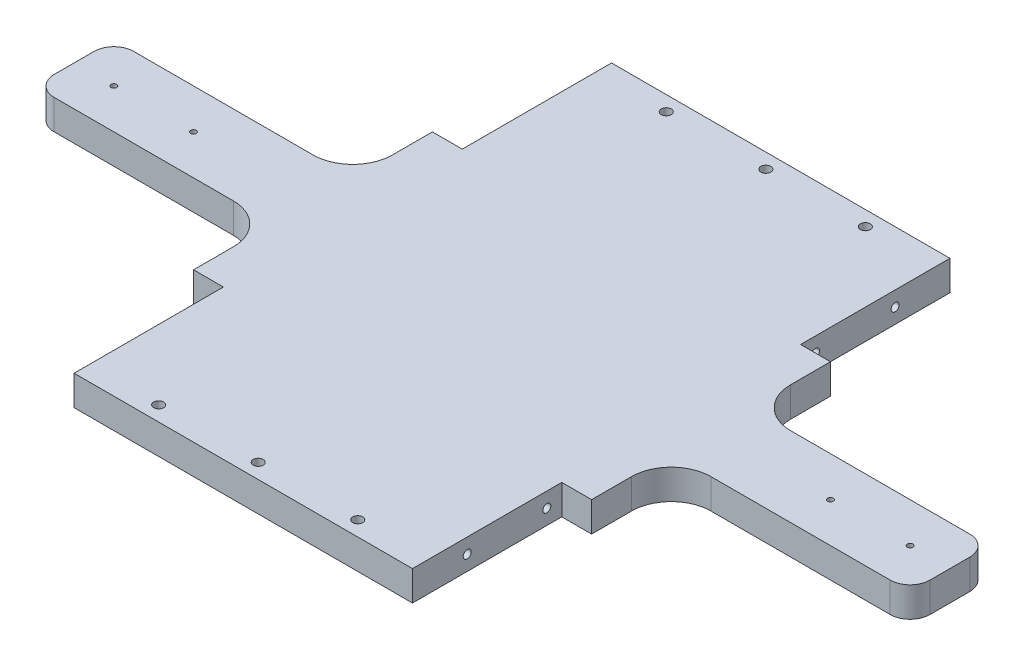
from build123d import *

# Parameters (mm, degrees)
SKETCH1_W                   = 152.4
SKETCH1_H                   = 50.8
SKETCH1_W_2                 = 254
SKETCH1_H_2                 = 342.9
BOSS_EXTRUDE1_DEPTH         = 19.05
SKETCH2_R                   = 1.778
CUT_EXTRUDE1_DEPTH          = 329.363160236
FILLET1_R                   = 12.7
FILLET2_R                   = 12.7
FILLET3_R                   = 12.7
FILLET4_R                   = 12.7
FILLET5_R                   = 25.4
FILLET6_R                   = 25.4
FILLET7_R                   = 25.4
FILLET8_R                   = 25.4
F_1_4_0_25_DIAMETER_HOLE1_D = 6.35
F_1_4_0_25_DIAMETER_HOLE2_D = 6.35
MIRROR2_COPY_1_D            = 6.35
SKETCH8_W                   = 95.25
SKETCH8_H                   = 19.05
CUT_EXTRUDE2_DEPTH          = 19.05
MIRROR5_COPY_1_SKETCH_W     = 95.25
MIRROR5_COPY_1_SKETCH_H     = 19.05
MIRROR5_COPY_1_DEPTH        = 19.05
MIRROR5_COPY_2_SKETCH_W     = 95.25
MIRROR5_COPY_2_SKETCH_H     = 19.05
MIRROR5_COPY_2_DEPTH        = 19.05


with BuildPart() as part:
    # Sketch1 → Boss-Extrude1 (new body)
    with BuildSketch(Plane(origin=(0, 0, 0), x_dir=(1, 0, 0), z_dir=(0, 1, 0))):
        with Locations((-203.2, 0)):
            Rectangle(SKETCH1_W, SKETCH1_H)
        Rectangle(SKETCH1_W_2, SKETCH1_H_2)
        with Locations((203.2, 0)):
            Rectangle(SKETCH1_W, SKETCH1_H)
    extrude(amount=BOSS_EXTRUDE1_DEPTH)

    # Sketch2 → Cut-Extrude1 (cut, through all)
    with BuildSketch(Plane(origin=(0, 19.05, 0), x_dir=(1, 0, 0), z_dir=(0, 1, 0))):
        with Locations(Location((-203.200007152, -0.033015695, 0), (0, 0, 270))):
            Circle(SKETCH2_R)
        with Locations(Location((-254.000002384, -0.0110051, 0), (0, 0, 270))):
            Circle(SKETCH2_R)
        with Locations(Location((203.2, 0, 0), (0, 0, 270))):
            Circle(SKETCH2_R)
        with Locations(Location((254, 0, 0), (0, 0, 270))):
            Circle(SKETCH2_R)
    extrude(amount=-CUT_EXTRUDE1_DEPTH, mode=Mode.SUBTRACT)

    # Fillet1
    fillet1_edges = [part.edges().sort_by_distance(p)[0] for p in [
        (-279.4, 9.525, 25.4),
    ]]
    fillet(fillet1_edges, radius=FILLET1_R)

    # Fillet2
    fillet2_edges = [part.edges().sort_by_distance(p)[0] for p in [
        (-279.4, 9.525, -25.4),
    ]]
    fillet(fillet2_edges, radius=FILLET2_R)

    # Fillet3
    fillet3_edges = [part.edges().sort_by_distance(p)[0] for p in [
        (279.4, 9.525, -25.4),
    ]]
    fillet(fillet3_edges, radius=FILLET3_R)

    # Fillet4
    fillet4_edges = [part.edges().sort_by_distance(p)[0] for p in [
        (279.4, 9.525, 25.4),
    ]]
    fillet(fillet4_edges, radius=FILLET4_R)

    # Fillet5
    fillet5_edges = [part.edges().sort_by_distance(p)[0] for p in [
        (127, 9.525, -25.4),
    ]]
    fillet(fillet5_edges, radius=FILLET5_R)

    # Fillet6
    fillet6_edges = [part.edges().sort_by_distance(p)[0] for p in [
        (127, 9.525, 25.4),
    ]]
    fillet(fillet6_edges, radius=FILLET6_R)

    # Fillet7
    fillet7_edges = [part.edges().sort_by_distance(p)[0] for p in [
        (-127, 9.525, 25.4),
    ]]
    fillet(fillet7_edges, radius=FILLET7_R)

    # Fillet8
    fillet8_edges = [part.edges().sort_by_distance(p)[0] for p in [
        (-127, 9.525, -25.4),
    ]]
    fillet(fillet8_edges, radius=FILLET8_R)

    # 1_4 _0.25_ Diameter Hole1 (through all)
    with Locations(Plane(origin=(0, 19.05, 0), x_dir=(1, 0, 0), z_dir=(0, 1, 0))):
        with Locations((63.5, 161.925)):
            f_1_4_0_25_diameter_hole1 = Hole(F_1_4_0_25_DIAMETER_HOLE1_D / 2)

    # Mirror1: 1_4 _0.25_ Diameter Hole1 across plane
    add(f_1_4_0_25_diameter_hole1.mirror(Plane(origin=(0, 0, 0), x_dir=(0, 0, 1), z_dir=(1, 0, 0))), mode=Mode.SUBTRACT)

    # 1_4 _0.25_ Diameter Hole2 (through all)
    with Locations(Plane(origin=(0, 19.05, 0), x_dir=(1, 0, 0), z_dir=(0, 1, 0))):
        with Locations((0, 161.925)):
            f_1_4_0_25_diameter_hole2 = Hole(F_1_4_0_25_DIAMETER_HOLE2_D / 2)

    # Mirror2: 1_4 _0.25_ Diameter Hole1, 1_4 _0.25_ Diameter Hole2 across plane
    add(f_1_4_0_25_diameter_hole1.mirror(Plane.XY), mode=Mode.SUBTRACT)
    add(f_1_4_0_25_diameter_hole2.mirror(Plane.XY), mode=Mode.SUBTRACT)

    # Mirror2 copy 1 (through all)
    with Locations(Plane(origin=(0, 19.05, 0), x_dir=(-1, 0, 0), z_dir=(0, 1, 0))):
        with Locations((63.5, 161.925)):
            Hole(MIRROR2_COPY_1_D / 2)

    # Sketch8 → Cut-Extrude2 (cut)
    with BuildSketch(Plane(origin=(127, 0, 0), x_dir=(0, 0, -1), z_dir=(1, 0, 0))):
        with Locations((123.825, 9.525)):
            Rectangle(SKETCH8_W, SKETCH8_H)
    cut_extrude2 = extrude(amount=-CUT_EXTRUDE2_DEPTH, mode=Mode.SUBTRACT)

    # Mirror3: Cut-Extrude2 across plane
    add(cut_extrude2.mirror(Plane.XY), mode=Mode.SUBTRACT)

    # Mirror4: Cut-Extrude2 across plane
    add(cut_extrude2.mirror(Plane(origin=(0, 0, 0), x_dir=(0, 0, 1), z_dir=(1, 0, 0))), mode=Mode.SUBTRACT)

    # Mirror5 copy 1 sketch → Mirror5 copy 1 (cut)
    with BuildSketch(Plane.ZY.offset(127)):
        with Locations((123.825, 9.525)):
            Rectangle(MIRROR5_COPY_1_SKETCH_W, MIRROR5_COPY_1_SKETCH_H)
    extrude(amount=-MIRROR5_COPY_1_DEPTH, mode=Mode.SUBTRACT)

    # Mirror5 copy 2 sketch → Mirror5 copy 2 (cut)
    with BuildSketch(Plane(origin=(127, 0, 0), x_dir=(0, 0, 1), z_dir=(1, 0, 0))):
        with Locations((123.825, -9.525)):
            Rectangle(MIRROR5_COPY_2_SKETCH_W, MIRROR5_COPY_2_SKETCH_H)
    extrude(amount=-MIRROR5_COPY_2_DEPTH, mode=Mode.SUBTRACT)

    # Sketch12 → 7 _0.201_ Diameter Hole1 (revolve, cut)
    with BuildSketch(Plane(origin=(-107.95, 9.525, -85.725), x_dir=(0, 0, 1), z_dir=(0, 1, 0))):
        Polygon((0, 0), (0, 52.333816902), (2.5527, 50.8), (2.5527, 0), align=None)
    f_7_0_201_diameter_hole1 = revolve(axis=Axis((-114.3, 9.525, -85.725), (1, 0, 0)), mode=Mode.SUBTRACT)

    # Sketch14 → 7 _0.201_ Diameter Hole2 (revolve, cut)
    with BuildSketch(Plane(origin=(-107.95, 9.525, -136.525), x_dir=(0, 0, 1), z_dir=(0, 1, 0))):
        Polygon((0, 0), (0, 52.333816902), (2.5527, 50.8), (2.5527, 0), align=None)
    f_7_0_201_diameter_hole2 = revolve(axis=Axis((-114.3, 9.525, -136.525), (1, 0, 0)), mode=Mode.SUBTRACT)

    # Mirror6: 7 _0.201_ Diameter Hole1, 7 _0.201_ Diameter Hole2 across plane
    add(f_7_0_201_diameter_hole1.mirror(Plane(origin=(0, 0, 0), x_dir=(0, 0, 1), z_dir=(1, 0, 0))), mode=Mode.SUBTRACT)
    add(f_7_0_201_diameter_hole2.mirror(Plane(origin=(0, 0, 0), x_dir=(0, 0, 1), z_dir=(1, 0, 0))), mode=Mode.SUBTRACT)

    # Mirror7: 7 _0.201_ Diameter Hole1, 7 _0.201_ Diameter Hole2 across plane
    add(f_7_0_201_diameter_hole1.mirror(Plane.XY), mode=Mode.SUBTRACT)
    add(f_7_0_201_diameter_hole2.mirror(Plane.XY), mode=Mode.SUBTRACT)

    # Mirror7 copy 1 sketch → Mirror7 copy 1 (revolve, cut)
    with BuildSketch(Plane(origin=(107.95, 9.525, 85.725), x_dir=(0, 0, -1), z_dir=(0, 1, 0))):
        Polygon((0, 0), (0, 52.333816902), (2.5527, 50.8), (2.5527, 0), align=None)
    revolve(axis=Axis((114.3, 9.525, 85.725), (-1, 0, 0)), mode=Mode.SUBTRACT)

    # Mirror7 copy 2 sketch → Mirror7 copy 2 (revolve, cut)
    with BuildSketch(Plane(origin=(107.95, 9.525, 136.525), x_dir=(0, 0, -1), z_dir=(0, 1, 0))):
        Polygon((0, 0), (0, 52.333816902), (2.5527, 50.8), (2.5527, 0), align=None)
    revolve(axis=Axis((114.3, 9.525, 136.525), (-1, 0, 0)), mode=Mode.SUBTRACT)


solid = part.part
